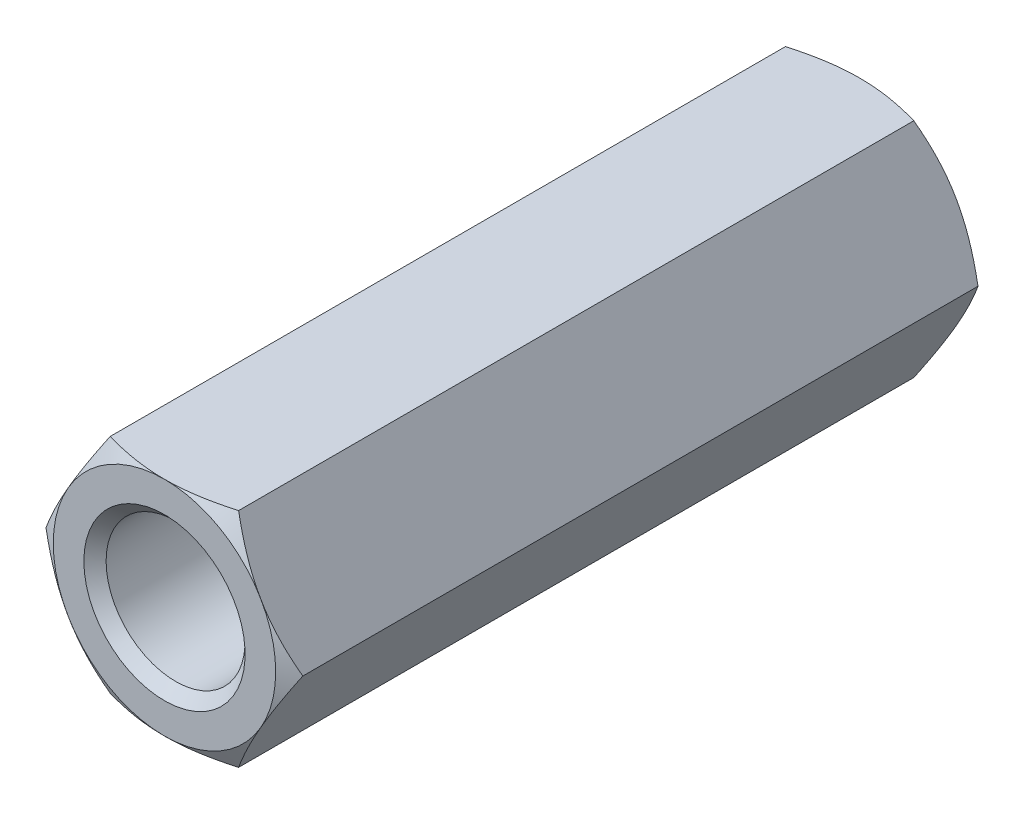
from build123d import *

# Parameters (mm, degrees)
BOSS_EXTRUDE1_DEPTH      = 12.5
SKETCH2_OUTSIDE_W        = 66.396
SKETCH2_OUTSIDE_H        = 65.158
SKETCH2_OUTSIDE_R        = 4
CUT_EXTRUDE1_DEPTH       = 14.913422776
CUT_EXTRUDE1_DRAFT       = -60
SKETCH3_R                = 2.5
SKETCH3_R_2              = 2.1
CUT_EXTRUDE2_DEPTH       = 10
SKETCH3_2_R              = 2.1
CUT_EXTRUDE3_DEPTH       = 11.2
CHAMFER1_SIZE            = 0.4
MIRROR1_COPY_1_SKETCH_W  = 66.396
MIRROR1_COPY_1_SKETCH_H  = 65.158
MIRROR1_COPY_1_SKETCH_R  = 4
MIRROR1_COPY_1_DEPTH     = 14.913422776
MIRROR1_COPY_1_DRAFT     = -60
CHAMFER1_OF_MIRROR1_SIZE = 0.4


with BuildPart() as part:
    # Sketch1 → Boss-Extrude1 (new body)
    with BuildSketch(Plane.XY):
        Polygon((2.309401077, 4), (-2.309401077, 4), (-4.618802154, 0), (-2.309401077, -4), (2.309401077, -4), (4.618802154, 0), align=None)
    boss_extrude1 = extrude(amount=-BOSS_EXTRUDE1_DEPTH)


with BuildPart() as cut_extrude1_tool:
    # Sketch2 outside → Cut-Extrude1 (with draft: the straight prism first)
    with BuildSketch(Plane(origin=(0, 0, -12.5), x_dir=(-1, 0, 0), z_dir=(0, 0, -1))):
        Rectangle(SKETCH2_OUTSIDE_W, SKETCH2_OUTSIDE_H)
        Circle(SKETCH2_OUTSIDE_R, mode=Mode.SUBTRACT)
    extrude(amount=-CUT_EXTRUDE1_DEPTH)
    # Cut-Extrude1: the draft: its side faces are tilted about the plane it starts from
    cut_extrude1_sides = [cut_extrude1_tool.faces().sort_by_distance(p)[0] for p in [
        (0, -32.579, -5.043288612),
        (-33.198, 0, -5.043288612),
        (0, 32.579, -5.043288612),
        (33.198, 0, -5.043288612),
        (4, 0, -5.043288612),
    ]]
    draft(cut_extrude1_sides, Plane(origin=(0, 0, -12.5), x_dir=(-1, 0, 0), z_dir=(0, 0, -1)), CUT_EXTRUDE1_DRAFT)


with BuildPart() as part_1:
    add(part.part)

    # Cut-Extrude1: cut by cut_extrude1_tool
    add(cut_extrude1_tool.part, mode=Mode.SUBTRACT)

    # Sketch3 → Cut-Extrude2 (cut)
    with BuildSketch(Plane(origin=(0, 0, -12.5), x_dir=(-1, 0, 0), z_dir=(0, 0, -1))):
        Circle(SKETCH3_R)
        Circle(SKETCH3_R_2, mode=Mode.SUBTRACT)
    cut_extrude2 = extrude(amount=-CUT_EXTRUDE2_DEPTH, mode=Mode.SUBTRACT)

    # Sketch3_2 → Cut-Extrude3 (cut)
    with BuildSketch(Plane(origin=(0, 0, -12.5), x_dir=(-1, 0, 0), z_dir=(0, 0, -1))):
        Circle(SKETCH3_2_R)
    cut_extrude3 = extrude(amount=-CUT_EXTRUDE3_DEPTH, mode=Mode.SUBTRACT)

    # Cut-Extrude4 cone 1 section (on through the dimple's axis) → Cut-Extrude4 (revolve, cut)
    with BuildSketch(Plane(origin=(0, 0, -1.3), x_dir=(0, 1, 0), z_dir=(1, 0, 0))):
        Polygon((0, 0), (2.1, 0), (0, 1.212435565), align=None)
    revolve(axis=Axis((0, 0, -1.3), (0, 0, 1)), mode=Mode.SUBTRACT)

    # Chamfer1
    chamfer1_edges = [part_1.edges().sort_by_distance(p)[0] for p in [
        (2.5, 0, -12.5),
    ]]
    chamfer(chamfer1_edges, length=CHAMFER1_SIZE)

    # Mirror1: Boss-Extrude1, Cut-Extrude2, Cut-Extrude3 across plane
    add(boss_extrude1.mirror(Plane.XY))
    add(cut_extrude2.mirror(Plane.XY), mode=Mode.SUBTRACT)
    add(cut_extrude3.mirror(Plane.XY), mode=Mode.SUBTRACT)


with BuildPart() as mirror1_copy_1_tool:
    # Mirror1 copy 1 sketch → Mirror1 copy 1 (with draft: the straight prism first)
    with BuildSketch(Plane(origin=(0, 0, 12.5), x_dir=(-1, 0, 0), z_dir=(0, 0, 1))):
        Rectangle(MIRROR1_COPY_1_SKETCH_W, MIRROR1_COPY_1_SKETCH_H)
        Circle(MIRROR1_COPY_1_SKETCH_R, mode=Mode.SUBTRACT)
    extrude(amount=-MIRROR1_COPY_1_DEPTH)
    # Mirror1 copy 1: the draft: its side faces are tilted about the plane it starts from
    mirror1_copy_1_sides = [mirror1_copy_1_tool.faces().sort_by_distance(p)[0] for p in [
        (0, -32.579, 5.043288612),
        (-33.198, 0, 5.043288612),
        (0, 32.579, 5.043288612),
        (33.198, 0, 5.043288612),
        (4, 0, 5.043288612),
    ]]
    draft(mirror1_copy_1_sides, Plane(origin=(0, 0, 12.5), x_dir=(-1, 0, 0), z_dir=(0, 0, 1)), MIRROR1_COPY_1_DRAFT)


with BuildPart() as part_2:
    add(part_1.part)

    # Mirror1 copy 1: cut by mirror1_copy_1_tool
    add(mirror1_copy_1_tool.part, mode=Mode.SUBTRACT)

    # Chamfer1 of Mirror1
    chamfer1_of_mirror1_edges = [part_2.edges().sort_by_distance(p)[0] for p in [
        (2.5, 0, 12.5),
    ]]
    chamfer(chamfer1_of_mirror1_edges, length=CHAMFER1_OF_MIRROR1_SIZE)


solid = part_2.part
